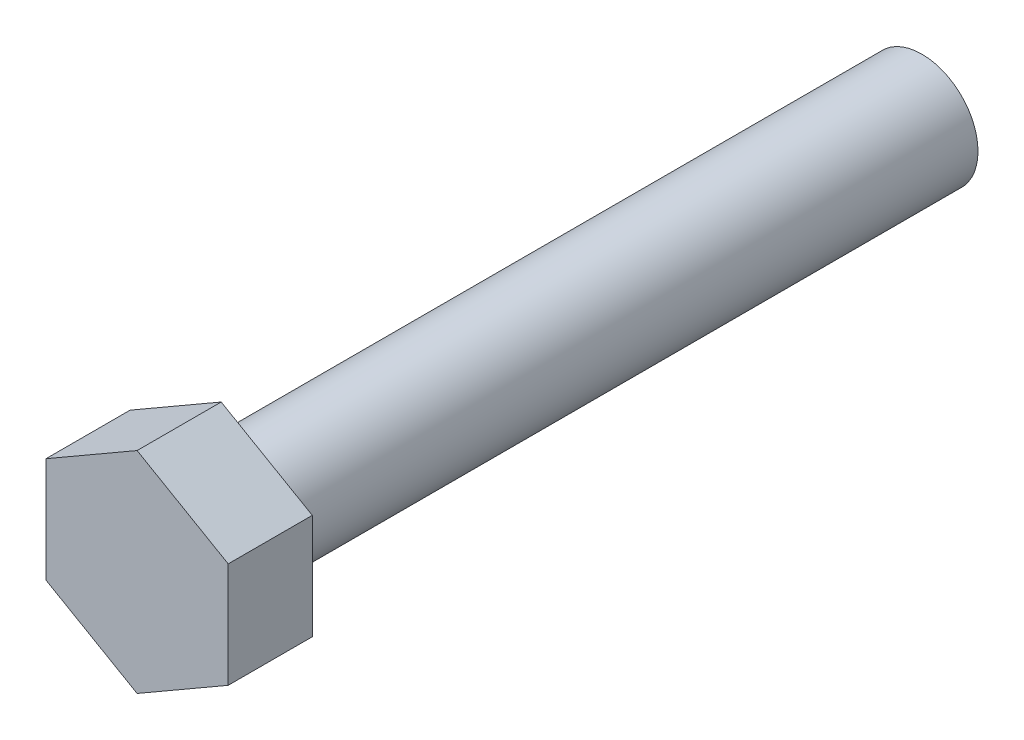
ISO-10303-21;
HEADER;
FILE_DESCRIPTION(('STEP AP214'),'2;1');
FILE_NAME('part.step','',(''),(''),'','','');
FILE_SCHEMA(('AUTOMOTIVE_DESIGN { 1 0 10303 214 1 1 1 1 }'));
ENDSEC;
DATA;
#1=APPLICATION_CONTEXT('core data for automotive mechanical design processes');
#2=APPLICATION_PROTOCOL_DEFINITION('international standard','automotive_design',2000,#1);
#3=PRODUCT_CONTEXT('',#1,'mechanical');
#4=PRODUCT('Part','Part','',(#3));
#5=PRODUCT_RELATED_PRODUCT_CATEGORY('part','',(#4));
#6=PRODUCT_DEFINITION_FORMATION('','',#4);
#7=PRODUCT_DEFINITION_CONTEXT('part definition',#1,'design');
#8=PRODUCT_DEFINITION('design','',#6,#7);
#9=PRODUCT_DEFINITION_SHAPE('','',#8);
#10=(LENGTH_UNIT() NAMED_UNIT(*) SI_UNIT(.MILLI.,.METRE.));
#11=(NAMED_UNIT(*) PLANE_ANGLE_UNIT() SI_UNIT($,.RADIAN.));
#12=(NAMED_UNIT(*) SI_UNIT($,.STERADIAN.) SOLID_ANGLE_UNIT());
#13=UNCERTAINTY_MEASURE_WITH_UNIT(LENGTH_MEASURE(1.E-05),#10,'distance_accuracy_value','');
#14=(GEOMETRIC_REPRESENTATION_CONTEXT(3) GLOBAL_UNCERTAINTY_ASSIGNED_CONTEXT((#13)) GLOBAL_UNIT_ASSIGNED_CONTEXT((#10,
#11,#12)) REPRESENTATION_CONTEXT('',''));
#15=CARTESIAN_POINT('',(0.,0.,0.));
#16=DIRECTION('',(0.,0.,1.));
#17=DIRECTION('',(1.,0.,0.));
#18=AXIS2_PLACEMENT_3D('',#15,#16,#17);
#19=CARTESIAN_POINT('',(13.,-7.50555349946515,12.));
#20=DIRECTION('',(-1.,0.,0.));
#21=DIRECTION('',(0.,-1.,0.));
#22=AXIS2_PLACEMENT_3D('',#19,#20,#21);
#23=PLANE('',#22);
#24=DIRECTION('',(0.,1.,0.));
#25=VECTOR('',#24,1.);
#26=CARTESIAN_POINT('',(13.,-7.50555349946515,0.));
#27=LINE('',#26,#25);
#28=CARTESIAN_POINT('',(13.,-7.50555349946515,0.));
#29=VERTEX_POINT('',#28);
#30=CARTESIAN_POINT('',(13.,7.50555349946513,0.));
#31=VERTEX_POINT('',#30);
#32=EDGE_CURVE('E118',#29,#31,#27,.T.);
#33=ORIENTED_EDGE('',*,*,#32,.T.);
#34=DIRECTION('',(0.,0.,-1.));
#35=VECTOR('',#34,1.);
#36=CARTESIAN_POINT('',(13.,7.50555349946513,12.));
#37=LINE('',#36,#35);
#38=CARTESIAN_POINT('',(13.,7.50555349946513,12.));
#39=VERTEX_POINT('',#38);
#40=EDGE_CURVE('E41',#39,#31,#37,.T.);
#41=ORIENTED_EDGE('',*,*,#40,.F.);
#42=DIRECTION('',(0.,1.,0.));
#43=VECTOR('',#42,1.);
#44=CARTESIAN_POINT('',(13.,-7.50555349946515,12.));
#45=LINE('',#44,#43);
#46=CARTESIAN_POINT('',(13.,-7.50555349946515,12.));
#47=VERTEX_POINT('',#46);
#48=EDGE_CURVE('E129',#47,#39,#45,.T.);
#49=ORIENTED_EDGE('',*,*,#48,.F.);
#50=DIRECTION('',(0.,0.,-1.));
#51=VECTOR('',#50,1.);
#52=CARTESIAN_POINT('',(13.,-7.50555349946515,12.));
#53=LINE('',#52,#51);
#54=EDGE_CURVE('E114',#47,#29,#53,.T.);
#55=ORIENTED_EDGE('',*,*,#54,.T.);
#56=EDGE_LOOP('',(#33,#41,#49,#55));
#57=FACE_BOUND('',#56,.T.);
#58=ADVANCED_FACE('F33',(#57),#23,.F.);
#59=CARTESIAN_POINT('',(13.,7.50555349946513,12.));
#60=DIRECTION('',(-0.5,-0.866025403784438,0.));
#61=DIRECTION('',(0.866025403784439,-0.5,0.));
#62=AXIS2_PLACEMENT_3D('',#59,#60,#61);
#63=PLANE('',#62);
#64=DIRECTION('',(-0.866025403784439,0.5,0.));
#65=VECTOR('',#64,1.);
#66=CARTESIAN_POINT('',(13.,7.50555349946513,0.));
#67=LINE('',#66,#65);
#68=CARTESIAN_POINT('',(0.,15.0111069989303,0.));
#69=VERTEX_POINT('',#68);
#70=EDGE_CURVE('E121',#31,#69,#67,.T.);
#71=ORIENTED_EDGE('',*,*,#70,.T.);
#72=DIRECTION('',(0.,0.,-1.));
#73=VECTOR('',#72,1.);
#74=CARTESIAN_POINT('',(0.,15.0111069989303,12.));
#75=LINE('',#74,#73);
#76=CARTESIAN_POINT('',(0.,15.0111069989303,12.));
#77=VERTEX_POINT('',#76);
#78=EDGE_CURVE('E133',#77,#69,#75,.T.);
#79=ORIENTED_EDGE('',*,*,#78,.F.);
#80=DIRECTION('',(-0.866025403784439,0.5,0.));
#81=VECTOR('',#80,1.);
#82=CARTESIAN_POINT('',(13.,7.50555349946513,12.));
#83=LINE('',#82,#81);
#84=EDGE_CURVE('E87',#39,#77,#83,.T.);
#85=ORIENTED_EDGE('',*,*,#84,.F.);
#86=ORIENTED_EDGE('',*,*,#40,.T.);
#87=EDGE_LOOP('',(#71,#79,#85,#86));
#88=FACE_BOUND('',#87,.T.);
#89=ADVANCED_FACE('F136',(#88),#63,.F.);
#90=CARTESIAN_POINT('',(0.,15.0111069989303,12.));
#91=DIRECTION('',(0.5,-0.866025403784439,0.));
#92=DIRECTION('',(0.866025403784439,0.5,0.));
#93=AXIS2_PLACEMENT_3D('',#90,#91,#92);
#94=PLANE('',#93);
#95=DIRECTION('',(-0.866025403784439,-0.5,0.));
#96=VECTOR('',#95,1.);
#97=CARTESIAN_POINT('',(0.,15.0111069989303,0.));
#98=LINE('',#97,#96);
#99=CARTESIAN_POINT('',(-13.,7.50555349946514,0.));
#100=VERTEX_POINT('',#99);
#101=EDGE_CURVE('E124',#69,#100,#98,.T.);
#102=ORIENTED_EDGE('',*,*,#101,.T.);
#103=DIRECTION('',(0.,0.,-1.));
#104=VECTOR('',#103,1.);
#105=CARTESIAN_POINT('',(-13.,7.50555349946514,12.));
#106=LINE('',#105,#104);
#107=CARTESIAN_POINT('',(-13.,7.50555349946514,12.));
#108=VERTEX_POINT('',#107);
#109=EDGE_CURVE('E109',#108,#100,#106,.T.);
#110=ORIENTED_EDGE('',*,*,#109,.F.);
#111=DIRECTION('',(-0.866025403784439,-0.5,0.));
#112=VECTOR('',#111,1.);
#113=CARTESIAN_POINT('',(0.,15.0111069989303,12.));
#114=LINE('',#113,#112);
#115=EDGE_CURVE('E100',#77,#108,#114,.T.);
#116=ORIENTED_EDGE('',*,*,#115,.F.);
#117=ORIENTED_EDGE('',*,*,#78,.T.);
#118=EDGE_LOOP('',(#102,#110,#116,#117));
#119=FACE_BOUND('',#118,.T.);
#120=ADVANCED_FACE('F144',(#119),#94,.F.);
#121=CARTESIAN_POINT('',(-13.,7.50555349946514,12.));
#122=DIRECTION('',(1.,0.,0.));
#123=DIRECTION('',(0.,0.,-1.));
#124=AXIS2_PLACEMENT_3D('',#121,#122,#123);
#125=PLANE('',#124);
#126=DIRECTION('',(0.,-1.,0.));
#127=VECTOR('',#126,1.);
#128=CARTESIAN_POINT('',(-13.,7.50555349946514,0.));
#129=LINE('',#128,#127);
#130=CARTESIAN_POINT('',(-13.,-7.50555349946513,0.));
#131=VERTEX_POINT('',#130);
#132=EDGE_CURVE('E108',#100,#131,#129,.T.);
#133=ORIENTED_EDGE('',*,*,#132,.T.);
#134=DIRECTION('',(0.,0.,-1.));
#135=VECTOR('',#134,1.);
#136=CARTESIAN_POINT('',(-13.,-7.50555349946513,12.));
#137=LINE('',#136,#135);
#138=CARTESIAN_POINT('',(-13.,-7.50555349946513,12.));
#139=VERTEX_POINT('',#138);
#140=EDGE_CURVE('E105',#139,#131,#137,.T.);
#141=ORIENTED_EDGE('',*,*,#140,.F.);
#142=DIRECTION('',(0.,-1.,0.));
#143=VECTOR('',#142,1.);
#144=CARTESIAN_POINT('',(-13.,7.50555349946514,12.));
#145=LINE('',#144,#143);
#146=EDGE_CURVE('E94',#108,#139,#145,.T.);
#147=ORIENTED_EDGE('',*,*,#146,.F.);
#148=ORIENTED_EDGE('',*,*,#109,.T.);
#149=EDGE_LOOP('',(#133,#141,#147,#148));
#150=FACE_BOUND('',#149,.T.);
#151=ADVANCED_FACE('F106',(#150),#125,.F.);
#152=CARTESIAN_POINT('',(-13.,-7.50555349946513,12.));
#153=DIRECTION('',(0.5,0.866025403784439,0.));
#154=DIRECTION('',(-0.866025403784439,0.5,0.));
#155=AXIS2_PLACEMENT_3D('',#152,#153,#154);
#156=PLANE('',#155);
#157=DIRECTION('',(0.866025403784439,-0.5,0.));
#158=VECTOR('',#157,1.);
#159=CARTESIAN_POINT('',(-13.,-7.50555349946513,0.));
#160=LINE('',#159,#158);
#161=CARTESIAN_POINT('',(0.,-15.0111069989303,0.));
#162=VERTEX_POINT('',#161);
#163=EDGE_CURVE('E72',#131,#162,#160,.T.);
#164=ORIENTED_EDGE('',*,*,#163,.T.);
#165=DIRECTION('',(0.,0.,-1.));
#166=VECTOR('',#165,1.);
#167=CARTESIAN_POINT('',(0.,-15.0111069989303,12.));
#168=LINE('',#167,#166);
#169=CARTESIAN_POINT('',(0.,-15.0111069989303,12.));
#170=VERTEX_POINT('',#169);
#171=EDGE_CURVE('E110',#170,#162,#168,.T.);
#172=ORIENTED_EDGE('',*,*,#171,.F.);
#173=DIRECTION('',(0.866025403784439,-0.5,0.));
#174=VECTOR('',#173,1.);
#175=CARTESIAN_POINT('',(-13.,-7.50555349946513,12.));
#176=LINE('',#175,#174);
#177=EDGE_CURVE('E98',#139,#170,#176,.T.);
#178=ORIENTED_EDGE('',*,*,#177,.F.);
#179=ORIENTED_EDGE('',*,*,#140,.T.);
#180=EDGE_LOOP('',(#164,#172,#178,#179));
#181=FACE_BOUND('',#180,.T.);
#182=ADVANCED_FACE('F112',(#181),#156,.F.);
#183=CARTESIAN_POINT('',(0.,-15.0111069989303,12.));
#184=DIRECTION('',(-0.5,0.866025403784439,0.));
#185=DIRECTION('',(-0.866025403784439,-0.5,0.));
#186=AXIS2_PLACEMENT_3D('',#183,#184,#185);
#187=PLANE('',#186);
#188=DIRECTION('',(0.866025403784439,0.5,0.));
#189=VECTOR('',#188,1.);
#190=CARTESIAN_POINT('',(0.,-15.0111069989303,0.));
#191=LINE('',#190,#189);
#192=EDGE_CURVE('E78',#162,#29,#191,.T.);
#193=ORIENTED_EDGE('',*,*,#192,.T.);
#194=ORIENTED_EDGE('',*,*,#54,.F.);
#195=DIRECTION('',(0.866025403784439,0.5,0.));
#196=VECTOR('',#195,1.);
#197=CARTESIAN_POINT('',(0.,-15.0111069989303,12.));
#198=LINE('',#197,#196);
#199=EDGE_CURVE('E49',#170,#47,#198,.T.);
#200=ORIENTED_EDGE('',*,*,#199,.F.);
#201=ORIENTED_EDGE('',*,*,#171,.T.);
#202=EDGE_LOOP('',(#193,#194,#200,#201));
#203=FACE_BOUND('',#202,.T.);
#204=ADVANCED_FACE('F164',(#203),#187,.F.);
#205=CARTESIAN_POINT('',(0.,0.,12.));
#206=DIRECTION('',(0.,0.,1.));
#207=DIRECTION('',(1.,0.,0.));
#208=AXIS2_PLACEMENT_3D('',#205,#206,#207);
#209=PLANE('',#208);
#210=ORIENTED_EDGE('',*,*,#48,.T.);
#211=ORIENTED_EDGE('',*,*,#84,.T.);
#212=ORIENTED_EDGE('',*,*,#115,.T.);
#213=ORIENTED_EDGE('',*,*,#146,.T.);
#214=ORIENTED_EDGE('',*,*,#177,.T.);
#215=ORIENTED_EDGE('',*,*,#199,.T.);
#216=EDGE_LOOP('',(#210,#211,#212,#213,#214,#215));
#217=FACE_BOUND('',#216,.T.);
#218=ADVANCED_FACE('F96',(#217),#209,.T.);
#219=CARTESIAN_POINT('',(0.,0.,0.));
#220=DIRECTION('',(0.,0.,1.));
#221=DIRECTION('',(1.,0.,0.));
#222=AXIS2_PLACEMENT_3D('',#219,#220,#221);
#223=PLANE('',#222);
#224=CARTESIAN_POINT('',(0.,0.,0.));
#225=DIRECTION('',(0.,0.,1.));
#226=DIRECTION('',(1.,0.,0.));
#227=AXIS2_PLACEMENT_3D('',#224,#225,#226);
#228=CIRCLE('',#227,8.);
#229=CARTESIAN_POINT('',(8.,0.,0.));
#230=VERTEX_POINT('',#229);
#231=EDGE_CURVE('E11',#230,#230,#228,.F.);
#232=ORIENTED_EDGE('',*,*,#231,.F.);
#233=EDGE_LOOP('',(#232));
#234=FACE_BOUND('',#233,.T.);
#235=ORIENTED_EDGE('',*,*,#32,.F.);
#236=ORIENTED_EDGE('',*,*,#192,.F.);
#237=ORIENTED_EDGE('',*,*,#163,.F.);
#238=ORIENTED_EDGE('',*,*,#132,.F.);
#239=ORIENTED_EDGE('',*,*,#101,.F.);
#240=ORIENTED_EDGE('',*,*,#70,.F.);
#241=EDGE_LOOP('',(#235,#236,#237,#238,#239,#240));
#242=FACE_BOUND('',#241,.T.);
#243=ADVANCED_FACE('F141',(#234,#242),#223,.F.);
#244=CARTESIAN_POINT('',(0.,0.,-100.));
#245=DIRECTION('',(0.,0.,1.));
#246=DIRECTION('',(1.,0.,0.));
#247=AXIS2_PLACEMENT_3D('',#244,#245,#246);
#248=CYLINDRICAL_SURFACE('',#247,8.);
#249=CARTESIAN_POINT('',(0.,0.,-100.));
#250=DIRECTION('',(0.,0.,-1.));
#251=DIRECTION('',(-1.,0.,0.));
#252=AXIS2_PLACEMENT_3D('',#249,#250,#251);
#253=CIRCLE('',#252,8.);
#254=CARTESIAN_POINT('',(-8.,0.,-100.));
#255=VERTEX_POINT('',#254);
#256=EDGE_CURVE('E122',#255,#255,#253,.T.);
#257=ORIENTED_EDGE('',*,*,#256,.F.);
#258=EDGE_LOOP('',(#257));
#259=FACE_BOUND('',#258,.T.);
#260=ORIENTED_EDGE('',*,*,#231,.T.);
#261=EDGE_LOOP('',(#260));
#262=FACE_BOUND('',#261,.T.);
#263=ADVANCED_FACE('F153',(#259,#262),#248,.T.);
#264=CARTESIAN_POINT('',(0.,0.,-100.));
#265=DIRECTION('',(0.,0.,-1.));
#266=DIRECTION('',(-1.,0.,0.));
#267=AXIS2_PLACEMENT_3D('',#264,#265,#266);
#268=PLANE('',#267);
#269=ORIENTED_EDGE('',*,*,#256,.T.);
#270=EDGE_LOOP('',(#269));
#271=FACE_BOUND('',#270,.T.);
#272=ADVANCED_FACE('F151',(#271),#268,.T.);
#273=CLOSED_SHELL('',(#58,#89,#120,#151,#182,#204,#218,#243,#263,#272));
#274=MANIFOLD_SOLID_BREP('B2',#273);
#275=ADVANCED_BREP_SHAPE_REPRESENTATION('',(#18,#274),#14);
#276=SHAPE_DEFINITION_REPRESENTATION(#9,#275);
ENDSEC;
END-ISO-10303-21;
